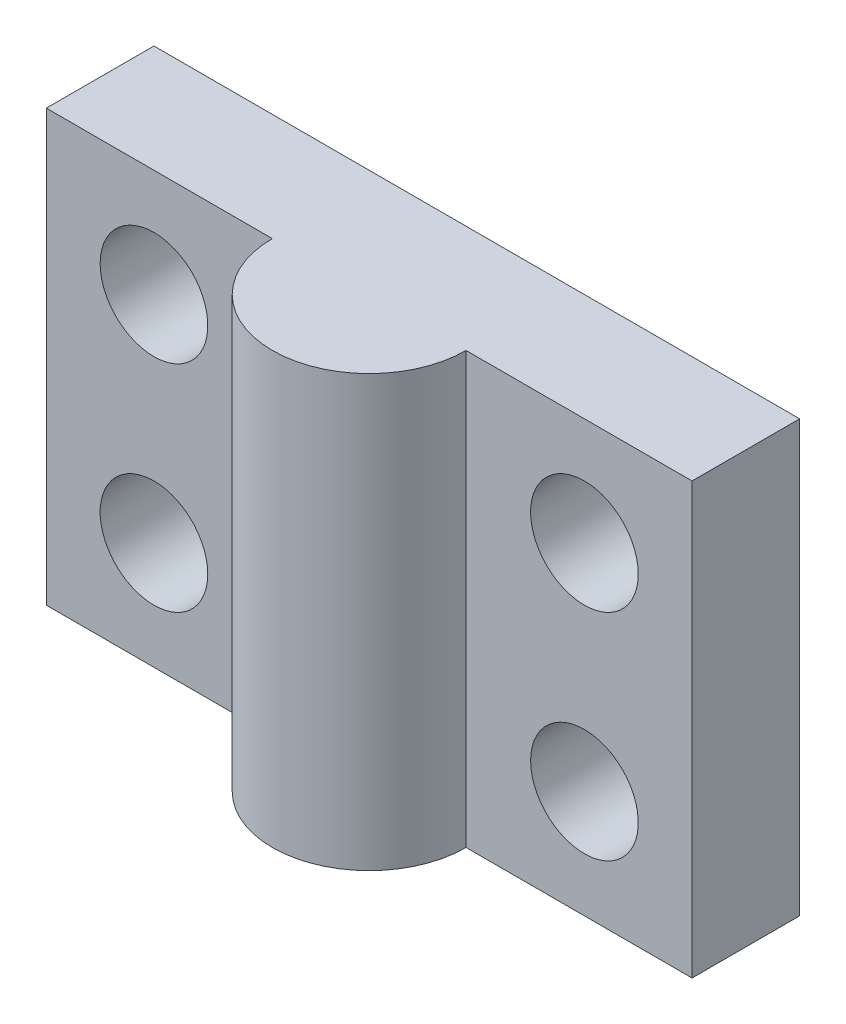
ISO-10303-21;
HEADER;
FILE_DESCRIPTION(('STEP AP214'),'2;1');
FILE_NAME('part.step','',(''),(''),'','','');
FILE_SCHEMA(('AUTOMOTIVE_DESIGN { 1 0 10303 214 1 1 1 1 }'));
ENDSEC;
DATA;
#1=APPLICATION_CONTEXT('core data for automotive mechanical design processes');
#2=APPLICATION_PROTOCOL_DEFINITION('international standard','automotive_design',2000,#1);
#3=PRODUCT_CONTEXT('',#1,'mechanical');
#4=PRODUCT('Part','Part','',(#3));
#5=PRODUCT_RELATED_PRODUCT_CATEGORY('part','',(#4));
#6=PRODUCT_DEFINITION_FORMATION('','',#4);
#7=PRODUCT_DEFINITION_CONTEXT('part definition',#1,'design');
#8=PRODUCT_DEFINITION('design','',#6,#7);
#9=PRODUCT_DEFINITION_SHAPE('','',#8);
#10=(LENGTH_UNIT() NAMED_UNIT(*) SI_UNIT(.MILLI.,.METRE.));
#11=(NAMED_UNIT(*) PLANE_ANGLE_UNIT() SI_UNIT($,.RADIAN.));
#12=(NAMED_UNIT(*) SI_UNIT($,.STERADIAN.) SOLID_ANGLE_UNIT());
#13=UNCERTAINTY_MEASURE_WITH_UNIT(LENGTH_MEASURE(1.E-05),#10,'distance_accuracy_value','');
#14=(GEOMETRIC_REPRESENTATION_CONTEXT(3) GLOBAL_UNCERTAINTY_ASSIGNED_CONTEXT((#13)) GLOBAL_UNIT_ASSIGNED_CONTEXT((#10,
#11,#12)) REPRESENTATION_CONTEXT('',''));
#15=CARTESIAN_POINT('',(0.,0.,0.));
#16=DIRECTION('',(0.,0.,1.));
#17=DIRECTION('',(1.,0.,0.));
#18=AXIS2_PLACEMENT_3D('',#15,#16,#17);
#19=CARTESIAN_POINT('',(0.,0.,5.));
#20=DIRECTION('',(0.,0.,-1.));
#21=DIRECTION('',(-1.,0.,0.));
#22=AXIS2_PLACEMENT_3D('',#19,#20,#21);
#23=PLANE('',#22);
#24=CARTESIAN_POINT('',(-10.,5.,5.));
#25=DIRECTION('',(0.,0.,1.));
#26=DIRECTION('',(-1.,0.,0.));
#27=AXIS2_PLACEMENT_3D('',#24,#25,#26);
#28=CIRCLE('',#27,2.5);
#29=CARTESIAN_POINT('',(-12.5,5.,5.));
#30=VERTEX_POINT('',#29);
#31=EDGE_CURVE('E116',#30,#30,#28,.T.);
#32=ORIENTED_EDGE('',*,*,#31,.F.);
#33=EDGE_LOOP('',(#32));
#34=FACE_BOUND('',#33,.T.);
#35=CARTESIAN_POINT('',(-10.,-5.,5.));
#36=DIRECTION('',(0.,0.,1.));
#37=DIRECTION('',(1.,0.,0.));
#38=AXIS2_PLACEMENT_3D('',#35,#36,#37);
#39=CIRCLE('',#38,2.5);
#40=CARTESIAN_POINT('',(-7.5,-5.,5.));
#41=VERTEX_POINT('',#40);
#42=EDGE_CURVE('E122',#41,#41,#39,.T.);
#43=ORIENTED_EDGE('',*,*,#42,.F.);
#44=EDGE_LOOP('',(#43));
#45=FACE_BOUND('',#44,.T.);
#46=DIRECTION('',(1.,0.,0.));
#47=VECTOR('',#46,1.);
#48=CARTESIAN_POINT('',(-15.,-10.,5.));
#49=LINE('',#48,#47);
#50=CARTESIAN_POINT('',(-15.,-10.,5.));
#51=VERTEX_POINT('',#50);
#52=CARTESIAN_POINT('',(-4.5,-10.,5.));
#53=VERTEX_POINT('',#52);
#54=EDGE_CURVE('E99',#51,#53,#49,.T.);
#55=ORIENTED_EDGE('',*,*,#54,.T.);
#56=DIRECTION('',(0.,1.,0.));
#57=VECTOR('',#56,1.);
#58=CARTESIAN_POINT('',(-4.5,-10.,5.));
#59=LINE('',#58,#57);
#60=CARTESIAN_POINT('',(-4.5,10.,5.));
#61=VERTEX_POINT('',#60);
#62=EDGE_CURVE('E52',#53,#61,#59,.T.);
#63=ORIENTED_EDGE('',*,*,#62,.T.);
#64=DIRECTION('',(-1.,0.,0.));
#65=VECTOR('',#64,1.);
#66=CARTESIAN_POINT('',(-15.,10.,5.));
#67=LINE('',#66,#65);
#68=CARTESIAN_POINT('',(-15.,10.,5.));
#69=VERTEX_POINT('',#68);
#70=EDGE_CURVE('E142',#61,#69,#67,.T.);
#71=ORIENTED_EDGE('',*,*,#70,.T.);
#72=DIRECTION('',(0.,-1.,0.));
#73=VECTOR('',#72,1.);
#74=CARTESIAN_POINT('',(-15.,-10.,5.));
#75=LINE('',#74,#73);
#76=EDGE_CURVE('E100',#69,#51,#75,.T.);
#77=ORIENTED_EDGE('',*,*,#76,.T.);
#78=EDGE_LOOP('',(#55,#63,#71,#77));
#79=FACE_BOUND('',#78,.T.);
#80=ADVANCED_FACE('F37',(#34,#45,#79),#23,.F.);
#81=CARTESIAN_POINT('',(15.,10.,5.));
#82=VERTEX_POINT('',#81);
#83=CARTESIAN_POINT('',(4.5,10.,5.));
#84=VERTEX_POINT('',#83);
#85=EDGE_CURVE('E60',#82,#84,#67,.T.);
#86=ORIENTED_EDGE('',*,*,#85,.T.);
#87=DIRECTION('',(0.,1.,0.));
#88=VECTOR('',#87,1.);
#89=CARTESIAN_POINT('',(4.5,-10.,5.));
#90=LINE('',#89,#88);
#91=CARTESIAN_POINT('',(4.5,-10.,5.));
#92=VERTEX_POINT('',#91);
#93=EDGE_CURVE('E102',#92,#84,#90,.T.);
#94=ORIENTED_EDGE('',*,*,#93,.F.);
#95=CARTESIAN_POINT('',(15.,-10.,5.));
#96=VERTEX_POINT('',#95);
#97=EDGE_CURVE('E91',#92,#96,#49,.T.);
#98=ORIENTED_EDGE('',*,*,#97,.T.);
#99=DIRECTION('',(0.,1.,0.));
#100=VECTOR('',#99,1.);
#101=CARTESIAN_POINT('',(15.,-10.,5.));
#102=LINE('',#101,#100);
#103=EDGE_CURVE('E140',#96,#82,#102,.T.);
#104=ORIENTED_EDGE('',*,*,#103,.T.);
#105=EDGE_LOOP('',(#86,#94,#98,#104));
#106=FACE_BOUND('',#105,.T.);
#107=CARTESIAN_POINT('',(10.,5.,5.));
#108=DIRECTION('',(0.,0.,1.));
#109=DIRECTION('',(1.,0.,0.));
#110=AXIS2_PLACEMENT_3D('',#107,#108,#109);
#111=CIRCLE('',#110,2.5);
#112=CARTESIAN_POINT('',(12.5,5.,5.));
#113=VERTEX_POINT('',#112);
#114=EDGE_CURVE('E134',#113,#113,#111,.T.);
#115=ORIENTED_EDGE('',*,*,#114,.F.);
#116=EDGE_LOOP('',(#115));
#117=FACE_BOUND('',#116,.T.);
#118=CARTESIAN_POINT('',(10.,-5.,5.));
#119=DIRECTION('',(0.,0.,1.));
#120=DIRECTION('',(-1.,0.,0.));
#121=AXIS2_PLACEMENT_3D('',#118,#119,#120);
#122=CIRCLE('',#121,2.5);
#123=CARTESIAN_POINT('',(7.5,-5.,5.));
#124=VERTEX_POINT('',#123);
#125=EDGE_CURVE('E128',#124,#124,#122,.T.);
#126=ORIENTED_EDGE('',*,*,#125,.F.);
#127=EDGE_LOOP('',(#126));
#128=FACE_BOUND('',#127,.T.);
#129=ADVANCED_FACE('F103',(#106,#117,#128),#23,.F.);
#130=CARTESIAN_POINT('',(0.,0.,0.));
#131=DIRECTION('',(0.,0.,-1.));
#132=DIRECTION('',(-1.,0.,0.));
#133=AXIS2_PLACEMENT_3D('',#130,#131,#132);
#134=PLANE('',#133);
#135=CARTESIAN_POINT('',(-10.,-5.,0.));
#136=DIRECTION('',(0.,0.,1.));
#137=DIRECTION('',(1.,0.,0.));
#138=AXIS2_PLACEMENT_3D('',#135,#136,#137);
#139=CIRCLE('',#138,2.5);
#140=CARTESIAN_POINT('',(-7.5,-5.,0.));
#141=VERTEX_POINT('',#140);
#142=EDGE_CURVE('E119',#141,#141,#139,.T.);
#143=ORIENTED_EDGE('',*,*,#142,.T.);
#144=EDGE_LOOP('',(#143));
#145=FACE_BOUND('',#144,.T.);
#146=CARTESIAN_POINT('',(10.,5.,0.));
#147=DIRECTION('',(0.,0.,1.));
#148=DIRECTION('',(1.,0.,0.));
#149=AXIS2_PLACEMENT_3D('',#146,#147,#148);
#150=CIRCLE('',#149,2.5);
#151=CARTESIAN_POINT('',(12.5,5.,0.));
#152=VERTEX_POINT('',#151);
#153=EDGE_CURVE('E131',#152,#152,#150,.T.);
#154=ORIENTED_EDGE('',*,*,#153,.T.);
#155=EDGE_LOOP('',(#154));
#156=FACE_BOUND('',#155,.T.);
#157=DIRECTION('',(0.,1.,0.));
#158=VECTOR('',#157,1.);
#159=CARTESIAN_POINT('',(15.,-10.,0.));
#160=LINE('',#159,#158);
#161=CARTESIAN_POINT('',(15.,-10.,0.));
#162=VERTEX_POINT('',#161);
#163=CARTESIAN_POINT('',(15.,10.,0.));
#164=VERTEX_POINT('',#163);
#165=EDGE_CURVE('E137',#162,#164,#160,.T.);
#166=ORIENTED_EDGE('',*,*,#165,.F.);
#167=DIRECTION('',(1.,0.,0.));
#168=VECTOR('',#167,1.);
#169=CARTESIAN_POINT('',(-15.,-10.,0.));
#170=LINE('',#169,#168);
#171=CARTESIAN_POINT('',(-15.,-10.,0.));
#172=VERTEX_POINT('',#171);
#173=EDGE_CURVE('E143',#172,#162,#170,.T.);
#174=ORIENTED_EDGE('',*,*,#173,.F.);
#175=DIRECTION('',(0.,-1.,0.));
#176=VECTOR('',#175,1.);
#177=CARTESIAN_POINT('',(-15.,-10.,0.));
#178=LINE('',#177,#176);
#179=CARTESIAN_POINT('',(-15.,10.,0.));
#180=VERTEX_POINT('',#179);
#181=EDGE_CURVE('E150',#180,#172,#178,.T.);
#182=ORIENTED_EDGE('',*,*,#181,.F.);
#183=DIRECTION('',(-1.,0.,0.));
#184=VECTOR('',#183,1.);
#185=CARTESIAN_POINT('',(-15.,10.,0.));
#186=LINE('',#185,#184);
#187=EDGE_CURVE('E148',#164,#180,#186,.T.);
#188=ORIENTED_EDGE('',*,*,#187,.F.);
#189=EDGE_LOOP('',(#166,#174,#182,#188));
#190=FACE_BOUND('',#189,.T.);
#191=CARTESIAN_POINT('',(10.,-5.,0.));
#192=DIRECTION('',(0.,0.,1.));
#193=DIRECTION('',(-1.,0.,0.));
#194=AXIS2_PLACEMENT_3D('',#191,#192,#193);
#195=CIRCLE('',#194,2.5);
#196=CARTESIAN_POINT('',(7.5,-5.,0.));
#197=VERTEX_POINT('',#196);
#198=EDGE_CURVE('E125',#197,#197,#195,.T.);
#199=ORIENTED_EDGE('',*,*,#198,.T.);
#200=EDGE_LOOP('',(#199));
#201=FACE_BOUND('',#200,.T.);
#202=CARTESIAN_POINT('',(-10.,5.,0.));
#203=DIRECTION('',(0.,0.,1.));
#204=DIRECTION('',(-1.,0.,0.));
#205=AXIS2_PLACEMENT_3D('',#202,#203,#204);
#206=CIRCLE('',#205,2.5);
#207=CARTESIAN_POINT('',(-12.5,5.,0.));
#208=VERTEX_POINT('',#207);
#209=EDGE_CURVE('E114',#208,#208,#206,.T.);
#210=ORIENTED_EDGE('',*,*,#209,.T.);
#211=EDGE_LOOP('',(#210));
#212=FACE_BOUND('',#211,.T.);
#213=ADVANCED_FACE('F167',(#145,#156,#190,#201,#212),#134,.T.);
#214=CARTESIAN_POINT('',(15.,-10.,5.));
#215=DIRECTION('',(-1.,0.,0.));
#216=DIRECTION('',(0.,-1.,0.));
#217=AXIS2_PLACEMENT_3D('',#214,#215,#216);
#218=PLANE('',#217);
#219=ORIENTED_EDGE('',*,*,#165,.T.);
#220=DIRECTION('',(0.,0.,-1.));
#221=VECTOR('',#220,1.);
#222=CARTESIAN_POINT('',(15.,10.,5.));
#223=LINE('',#222,#221);
#224=EDGE_CURVE('E11',#82,#164,#223,.T.);
#225=ORIENTED_EDGE('',*,*,#224,.F.);
#226=ORIENTED_EDGE('',*,*,#103,.F.);
#227=DIRECTION('',(0.,0.,-1.));
#228=VECTOR('',#227,1.);
#229=CARTESIAN_POINT('',(15.,-10.,5.));
#230=LINE('',#229,#228);
#231=EDGE_CURVE('E97',#96,#162,#230,.T.);
#232=ORIENTED_EDGE('',*,*,#231,.T.);
#233=EDGE_LOOP('',(#219,#225,#226,#232));
#234=FACE_BOUND('',#233,.T.);
#235=ADVANCED_FACE('F39',(#234),#218,.F.);
#236=CARTESIAN_POINT('',(-15.,10.,5.));
#237=DIRECTION('',(0.,-1.,0.));
#238=DIRECTION('',(0.,0.,-1.));
#239=AXIS2_PLACEMENT_3D('',#236,#237,#238);
#240=PLANE('',#239);
#241=ORIENTED_EDGE('',*,*,#187,.T.);
#242=DIRECTION('',(0.,0.,-1.));
#243=VECTOR('',#242,1.);
#244=CARTESIAN_POINT('',(-15.,10.,5.));
#245=LINE('',#244,#243);
#246=EDGE_CURVE('E45',#69,#180,#245,.T.);
#247=ORIENTED_EDGE('',*,*,#246,.F.);
#248=ORIENTED_EDGE('',*,*,#70,.F.);
#249=CARTESIAN_POINT('',(0.,10.,5.));
#250=DIRECTION('',(0.,1.,0.));
#251=DIRECTION('',(0.,0.,1.));
#252=AXIS2_PLACEMENT_3D('',#249,#250,#251);
#253=CIRCLE('',#252,4.5);
#254=EDGE_CURVE('E110',#61,#84,#253,.T.);
#255=ORIENTED_EDGE('',*,*,#254,.T.);
#256=ORIENTED_EDGE('',*,*,#85,.F.);
#257=ORIENTED_EDGE('',*,*,#224,.T.);
#258=EDGE_LOOP('',(#241,#247,#248,#255,#256,#257));
#259=FACE_BOUND('',#258,.T.);
#260=ADVANCED_FACE('F171',(#259),#240,.F.);
#261=CARTESIAN_POINT('',(-15.,-10.,5.));
#262=DIRECTION('',(1.,0.,0.));
#263=DIRECTION('',(0.,0.,-1.));
#264=AXIS2_PLACEMENT_3D('',#261,#262,#263);
#265=PLANE('',#264);
#266=ORIENTED_EDGE('',*,*,#181,.T.);
#267=DIRECTION('',(0.,0.,-1.));
#268=VECTOR('',#267,1.);
#269=CARTESIAN_POINT('',(-15.,-10.,5.));
#270=LINE('',#269,#268);
#271=EDGE_CURVE('E154',#51,#172,#270,.T.);
#272=ORIENTED_EDGE('',*,*,#271,.F.);
#273=ORIENTED_EDGE('',*,*,#76,.F.);
#274=ORIENTED_EDGE('',*,*,#246,.T.);
#275=EDGE_LOOP('',(#266,#272,#273,#274));
#276=FACE_BOUND('',#275,.T.);
#277=ADVANCED_FACE('F161',(#276),#265,.F.);
#278=CARTESIAN_POINT('',(-15.,-10.,5.));
#279=DIRECTION('',(0.,1.,0.));
#280=DIRECTION('',(0.,0.,1.));
#281=AXIS2_PLACEMENT_3D('',#278,#279,#280);
#282=PLANE('',#281);
#283=ORIENTED_EDGE('',*,*,#173,.T.);
#284=ORIENTED_EDGE('',*,*,#231,.F.);
#285=ORIENTED_EDGE('',*,*,#97,.F.);
#286=CARTESIAN_POINT('',(0.,-10.,5.));
#287=DIRECTION('',(0.,1.,0.));
#288=DIRECTION('',(0.,0.,1.));
#289=AXIS2_PLACEMENT_3D('',#286,#287,#288);
#290=CIRCLE('',#289,4.5);
#291=EDGE_CURVE('E95',#53,#92,#290,.T.);
#292=ORIENTED_EDGE('',*,*,#291,.F.);
#293=ORIENTED_EDGE('',*,*,#54,.F.);
#294=ORIENTED_EDGE('',*,*,#271,.T.);
#295=EDGE_LOOP('',(#283,#284,#285,#292,#293,#294));
#296=FACE_BOUND('',#295,.T.);
#297=ADVANCED_FACE('F92',(#296),#282,.F.);
#298=CARTESIAN_POINT('',(10.,5.,5.));
#299=DIRECTION('',(0.,0.,-1.));
#300=DIRECTION('',(-1.,0.,0.));
#301=AXIS2_PLACEMENT_3D('',#298,#299,#300);
#302=CYLINDRICAL_SURFACE('',#301,2.5);
#303=ORIENTED_EDGE('',*,*,#114,.T.);
#304=EDGE_LOOP('',(#303));
#305=FACE_BOUND('',#304,.T.);
#306=ORIENTED_EDGE('',*,*,#153,.F.);
#307=EDGE_LOOP('',(#306));
#308=FACE_BOUND('',#307,.T.);
#309=ADVANCED_FACE('F182',(#305,#308),#302,.F.);
#310=CARTESIAN_POINT('',(10.,-5.,5.));
#311=DIRECTION('',(0.,0.,-1.));
#312=DIRECTION('',(-1.,0.,0.));
#313=AXIS2_PLACEMENT_3D('',#310,#311,#312);
#314=CYLINDRICAL_SURFACE('',#313,2.5);
#315=ORIENTED_EDGE('',*,*,#125,.T.);
#316=EDGE_LOOP('',(#315));
#317=FACE_BOUND('',#316,.T.);
#318=ORIENTED_EDGE('',*,*,#198,.F.);
#319=EDGE_LOOP('',(#318));
#320=FACE_BOUND('',#319,.T.);
#321=ADVANCED_FACE('F248',(#317,#320),#314,.F.);
#322=CARTESIAN_POINT('',(-10.,-5.,5.));
#323=DIRECTION('',(0.,0.,-1.));
#324=DIRECTION('',(-1.,0.,0.));
#325=AXIS2_PLACEMENT_3D('',#322,#323,#324);
#326=CYLINDRICAL_SURFACE('',#325,2.5);
#327=ORIENTED_EDGE('',*,*,#42,.T.);
#328=EDGE_LOOP('',(#327));
#329=FACE_BOUND('',#328,.T.);
#330=ORIENTED_EDGE('',*,*,#142,.F.);
#331=EDGE_LOOP('',(#330));
#332=FACE_BOUND('',#331,.T.);
#333=ADVANCED_FACE('F240',(#329,#332),#326,.F.);
#334=CARTESIAN_POINT('',(-10.,5.,5.));
#335=DIRECTION('',(0.,0.,-1.));
#336=DIRECTION('',(-1.,0.,0.));
#337=AXIS2_PLACEMENT_3D('',#334,#335,#336);
#338=CYLINDRICAL_SURFACE('',#337,2.5);
#339=ORIENTED_EDGE('',*,*,#31,.T.);
#340=EDGE_LOOP('',(#339));
#341=FACE_BOUND('',#340,.T.);
#342=ORIENTED_EDGE('',*,*,#209,.F.);
#343=EDGE_LOOP('',(#342));
#344=FACE_BOUND('',#343,.T.);
#345=ADVANCED_FACE('F231',(#341,#344),#338,.F.);
#346=CARTESIAN_POINT('',(0.,-10.,5.));
#347=DIRECTION('',(0.,1.,0.));
#348=DIRECTION('',(0.,0.,1.));
#349=AXIS2_PLACEMENT_3D('',#346,#347,#348);
#350=CYLINDRICAL_SURFACE('',#349,4.5);
#351=ORIENTED_EDGE('',*,*,#254,.F.);
#352=ORIENTED_EDGE('',*,*,#62,.F.);
#353=ORIENTED_EDGE('',*,*,#291,.T.);
#354=ORIENTED_EDGE('',*,*,#93,.T.);
#355=EDGE_LOOP('',(#351,#352,#353,#354));
#356=FACE_BOUND('',#355,.T.);
#357=ADVANCED_FACE('F109',(#356),#350,.T.);
#358=CLOSED_SHELL('',(#80,#129,#213,#235,#260,#277,#297,#309,#321,#333,#345,#357));
#359=MANIFOLD_SOLID_BREP('B2',#358);
#360=ADVANCED_BREP_SHAPE_REPRESENTATION('',(#18,#359),#14);
#361=SHAPE_DEFINITION_REPRESENTATION(#9,#360);
ENDSEC;
END-ISO-10303-21;
